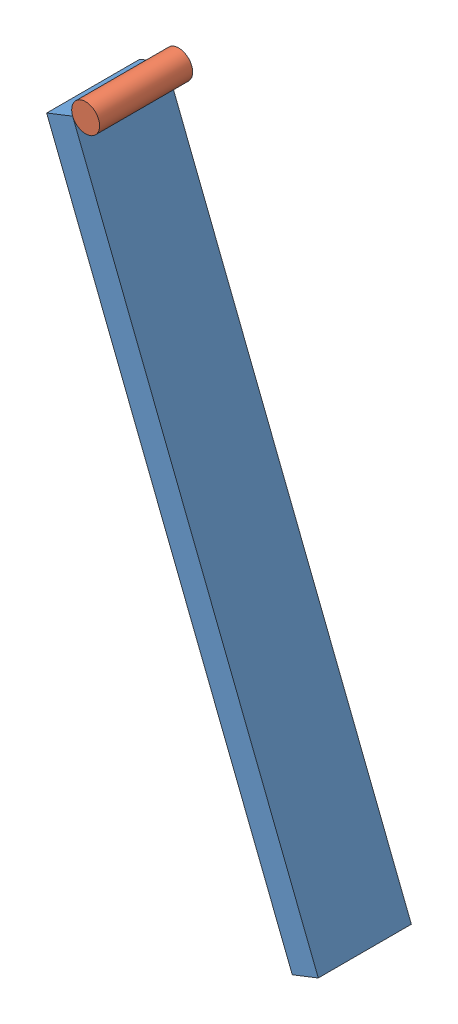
SolidWorks assembly Assemblage2.sldasm, configuration Défaut (file format 10000). Lengths in mm.
Overall size (29183.25 70594.63 10000).
2 component instances, 2 part files, 3 mates.
Components (placement in the parent):
- pente-1: pente.SLDPRT [Défaut] at origin size (29183.25 68099.5 10000)
- cylindre-1: cylindre.SLDPRT [Défaut] at (1395.6264 549.7518 0) x (0.930418 0.366501 0) z (0 0 1) size (3000 3000 10000)
Mates (geometry in assembly coordinates):
- Tangent2: tangent anti-aligned: plane of pente-1 through (26392.0019 -67000 5000) normal (0.930418 0.366501 0); cylinder of cylindre-1 through (1395.6645 549.655 5000) axis (0 0 -1) radius 1500
- Coïncidente3: coincident: plane of pente-1 through (0 0 5000) normal (0 0 1); plane of cylindre-1 through (1395.6645 549.655 5000) normal (0 0 1)
- Coïncidente4: coincident aligned: plane of pente-1 through (0 0 5000) normal (-0.366501 0.930418 0); plane of cylindre-1
